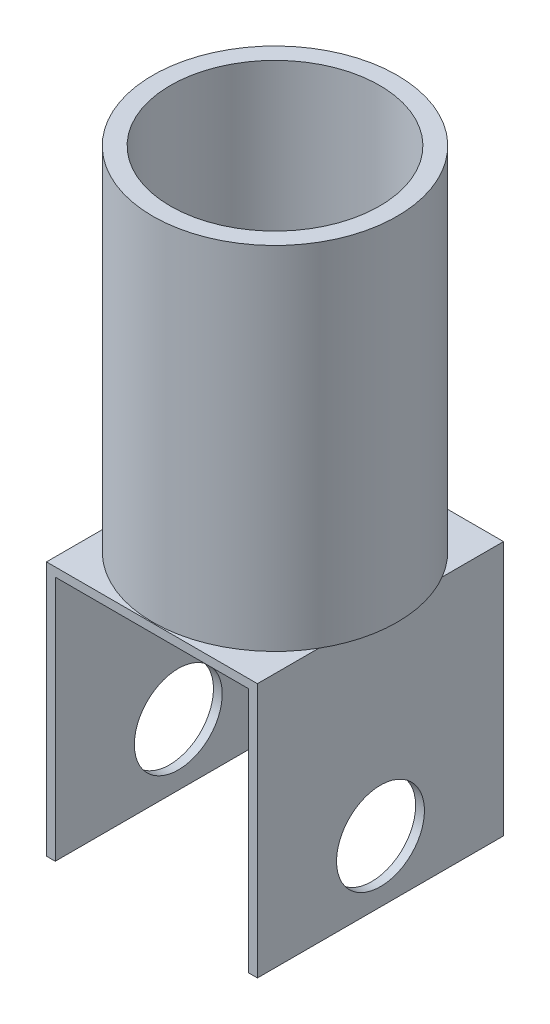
ISO-10303-21;
HEADER;
FILE_DESCRIPTION(('STEP AP214'),'2;1');
FILE_NAME('part.step','',(''),(''),'','','');
FILE_SCHEMA(('AUTOMOTIVE_DESIGN { 1 0 10303 214 1 1 1 1 }'));
ENDSEC;
DATA;
#1=APPLICATION_CONTEXT('core data for automotive mechanical design processes');
#2=APPLICATION_PROTOCOL_DEFINITION('international standard','automotive_design',2000,#1);
#3=PRODUCT_CONTEXT('',#1,'mechanical');
#4=PRODUCT('Part','Part','',(#3));
#5=PRODUCT_RELATED_PRODUCT_CATEGORY('part','',(#4));
#6=PRODUCT_DEFINITION_FORMATION('','',#4);
#7=PRODUCT_DEFINITION_CONTEXT('part definition',#1,'design');
#8=PRODUCT_DEFINITION('design','',#6,#7);
#9=PRODUCT_DEFINITION_SHAPE('','',#8);
#10=(LENGTH_UNIT() NAMED_UNIT(*) SI_UNIT(.MILLI.,.METRE.));
#11=(NAMED_UNIT(*) PLANE_ANGLE_UNIT() SI_UNIT($,.RADIAN.));
#12=(NAMED_UNIT(*) SI_UNIT($,.STERADIAN.) SOLID_ANGLE_UNIT());
#13=UNCERTAINTY_MEASURE_WITH_UNIT(LENGTH_MEASURE(1.E-05),#10,'distance_accuracy_value','');
#14=(GEOMETRIC_REPRESENTATION_CONTEXT(3) GLOBAL_UNCERTAINTY_ASSIGNED_CONTEXT((#13)) GLOBAL_UNIT_ASSIGNED_CONTEXT((#10,
#11,#12)) REPRESENTATION_CONTEXT('',''));
#15=CARTESIAN_POINT('',(0.,0.,0.));
#16=DIRECTION('',(0.,0.,1.));
#17=DIRECTION('',(1.,0.,0.));
#18=AXIS2_PLACEMENT_3D('',#15,#16,#17);
#19=CARTESIAN_POINT('',(0.,-5.,0.));
#20=DIRECTION('',(0.,1.,0.));
#21=DIRECTION('',(0.,0.,1.));
#22=AXIS2_PLACEMENT_3D('',#19,#20,#21);
#23=PLANE('',#22);
#24=DIRECTION('',(0.,0.,-1.));
#25=VECTOR('',#24,1.);
#26=CARTESIAN_POINT('',(55.,-5.,70.));
#27=LINE('',#26,#25);
#28=CARTESIAN_POINT('',(55.,-5.,70.));
#29=VERTEX_POINT('',#28);
#30=CARTESIAN_POINT('',(55.,-5.,-70.));
#31=VERTEX_POINT('',#30);
#32=EDGE_CURVE('E59',#29,#31,#27,.T.);
#33=ORIENTED_EDGE('',*,*,#32,.F.);
#34=DIRECTION('',(-1.,0.,0.));
#35=VECTOR('',#34,1.);
#36=CARTESIAN_POINT('',(-60.,-5.,70.));
#37=LINE('',#36,#35);
#38=CARTESIAN_POINT('',(-55.,-5.,70.));
#39=VERTEX_POINT('',#38);
#40=EDGE_CURVE('E172',#29,#39,#37,.T.);
#41=ORIENTED_EDGE('',*,*,#40,.T.);
#42=DIRECTION('',(0.,0.,1.));
#43=VECTOR('',#42,1.);
#44=CARTESIAN_POINT('',(-55.,-5.,70.));
#45=LINE('',#44,#43);
#46=CARTESIAN_POINT('',(-55.,-5.,-70.));
#47=VERTEX_POINT('',#46);
#48=EDGE_CURVE('E153',#47,#39,#45,.T.);
#49=ORIENTED_EDGE('',*,*,#48,.F.);
#50=DIRECTION('',(1.,0.,0.));
#51=VECTOR('',#50,1.);
#52=CARTESIAN_POINT('',(-60.,-5.,-70.));
#53=LINE('',#52,#51);
#54=EDGE_CURVE('E55',#47,#31,#53,.T.);
#55=ORIENTED_EDGE('',*,*,#54,.T.);
#56=EDGE_LOOP('',(#33,#41,#49,#55));
#57=FACE_BOUND('',#56,.T.);
#58=ADVANCED_FACE('F36',(#57),#23,.F.);
#59=CARTESIAN_POINT('',(0.,0.,0.));
#60=DIRECTION('',(0.,1.,0.));
#61=DIRECTION('',(0.,0.,1.));
#62=AXIS2_PLACEMENT_3D('',#59,#60,#61);
#63=PLANE('',#62);
#64=DIRECTION('',(0.,0.,1.));
#65=VECTOR('',#64,1.);
#66=CARTESIAN_POINT('',(60.,0.,-70.));
#67=LINE('',#66,#65);
#68=CARTESIAN_POINT('',(60.,0.,-35.0749198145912));
#69=VERTEX_POINT('',#68);
#70=CARTESIAN_POINT('',(60.,0.,35.0749198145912));
#71=VERTEX_POINT('',#70);
#72=EDGE_CURVE('E11',#69,#71,#67,.T.);
#73=ORIENTED_EDGE('',*,*,#72,.F.);
#74=CARTESIAN_POINT('',(0.,0.,0.));
#75=DIRECTION('',(0.,1.,0.));
#76=DIRECTION('',(0.,0.,1.));
#77=AXIS2_PLACEMENT_3D('',#74,#75,#76);
#78=CIRCLE('',#77,69.5);
#79=EDGE_CURVE('E198',#71,#69,#78,.T.);
#80=ORIENTED_EDGE('',*,*,#79,.F.);
#81=EDGE_LOOP('',(#73,#80));
#82=FACE_BOUND('',#81,.T.);
#83=ADVANCED_FACE('F246',(#82),#63,.F.);
#84=DIRECTION('',(0.,0.,-1.));
#85=VECTOR('',#84,1.);
#86=CARTESIAN_POINT('',(-60.,0.,-70.));
#87=LINE('',#86,#85);
#88=CARTESIAN_POINT('',(-60.,0.,35.0749198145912));
#89=VERTEX_POINT('',#88);
#90=CARTESIAN_POINT('',(-60.,0.,-35.0749198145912));
#91=VERTEX_POINT('',#90);
#92=EDGE_CURVE('E45',#89,#91,#87,.T.);
#93=ORIENTED_EDGE('',*,*,#92,.F.);
#94=EDGE_CURVE('E204',#91,#89,#78,.T.);
#95=ORIENTED_EDGE('',*,*,#94,.F.);
#96=EDGE_LOOP('',(#93,#95));
#97=FACE_BOUND('',#96,.T.);
#98=ADVANCED_FACE('F250',(#97),#63,.F.);
#99=CARTESIAN_POINT('',(0.,200.,0.));
#100=DIRECTION('',(0.,1.,0.));
#101=DIRECTION('',(0.,0.,1.));
#102=AXIS2_PLACEMENT_3D('',#99,#100,#101);
#103=PLANE('',#102);
#104=CARTESIAN_POINT('',(0.,200.,0.));
#105=DIRECTION('',(0.,1.,0.));
#106=DIRECTION('',(0.,0.,1.));
#107=AXIS2_PLACEMENT_3D('',#104,#105,#106);
#108=CIRCLE('',#107,69.5);
#109=CARTESIAN_POINT('',(0.,200.,69.5));
#110=VERTEX_POINT('',#109);
#111=EDGE_CURVE('E196',#110,#110,#108,.T.);
#112=ORIENTED_EDGE('',*,*,#111,.T.);
#113=EDGE_LOOP('',(#112));
#114=FACE_BOUND('',#113,.T.);
#115=CARTESIAN_POINT('',(0.,200.,0.));
#116=DIRECTION('',(0.,1.,0.));
#117=DIRECTION('',(0.,0.,1.));
#118=AXIS2_PLACEMENT_3D('',#115,#116,#117);
#119=CIRCLE('',#118,59.5);
#120=CARTESIAN_POINT('',(0.,200.,59.5));
#121=VERTEX_POINT('',#120);
#122=EDGE_CURVE('E190',#121,#121,#119,.T.);
#123=ORIENTED_EDGE('',*,*,#122,.F.);
#124=EDGE_LOOP('',(#123));
#125=FACE_BOUND('',#124,.T.);
#126=ADVANCED_FACE('F298',(#114,#125),#103,.T.);
#127=CARTESIAN_POINT('',(0.,200.,0.));
#128=DIRECTION('',(0.,-1.,0.));
#129=DIRECTION('',(0.,0.,-1.));
#130=AXIS2_PLACEMENT_3D('',#127,#128,#129);
#131=CYLINDRICAL_SURFACE('',#130,69.5);
#132=ORIENTED_EDGE('',*,*,#111,.F.);
#133=EDGE_LOOP('',(#132));
#134=FACE_BOUND('',#133,.T.);
#135=ORIENTED_EDGE('',*,*,#79,.T.);
#136=EDGE_CURVE('E200',#69,#91,#78,.T.);
#137=ORIENTED_EDGE('',*,*,#136,.T.);
#138=ORIENTED_EDGE('',*,*,#94,.T.);
#139=EDGE_CURVE('E193',#89,#71,#78,.T.);
#140=ORIENTED_EDGE('',*,*,#139,.T.);
#141=EDGE_LOOP('',(#135,#137,#138,#140));
#142=FACE_BOUND('',#141,.T.);
#143=ADVANCED_FACE('F38',(#134,#142),#131,.T.);
#144=CARTESIAN_POINT('',(0.,200.,0.));
#145=DIRECTION('',(0.,-1.,0.));
#146=DIRECTION('',(0.,0.,-1.));
#147=AXIS2_PLACEMENT_3D('',#144,#145,#146);
#148=CYLINDRICAL_SURFACE('',#147,59.5);
#149=ORIENTED_EDGE('',*,*,#122,.T.);
#150=EDGE_LOOP('',(#149));
#151=FACE_BOUND('',#150,.T.);
#152=CARTESIAN_POINT('',(0.,0.,0.));
#153=DIRECTION('',(0.,1.,0.));
#154=DIRECTION('',(0.,0.,1.));
#155=AXIS2_PLACEMENT_3D('',#152,#153,#154);
#156=CIRCLE('',#155,59.5);
#157=CARTESIAN_POINT('',(0.,0.,59.5));
#158=VERTEX_POINT('',#157);
#159=EDGE_CURVE('E125',#158,#158,#156,.T.);
#160=ORIENTED_EDGE('',*,*,#159,.F.);
#161=EDGE_LOOP('',(#160));
#162=FACE_BOUND('',#161,.T.);
#163=ADVANCED_FACE('F294',(#151,#162),#148,.F.);
#164=CARTESIAN_POINT('',(-60.,-5.,-70.));
#165=DIRECTION('',(0.,0.,1.));
#166=DIRECTION('',(1.,0.,0.));
#167=AXIS2_PLACEMENT_3D('',#164,#165,#166);
#168=PLANE('',#167);
#169=DIRECTION('',(1.,0.,0.));
#170=VECTOR('',#169,1.);
#171=CARTESIAN_POINT('',(-60.,0.,-70.));
#172=LINE('',#171,#170);
#173=CARTESIAN_POINT('',(-60.,0.,-70.));
#174=VERTEX_POINT('',#173);
#175=CARTESIAN_POINT('',(60.,0.,-70.));
#176=VERTEX_POINT('',#175);
#177=EDGE_CURVE('E174',#174,#176,#172,.T.);
#178=ORIENTED_EDGE('',*,*,#177,.T.);
#179=DIRECTION('',(0.,1.,0.));
#180=VECTOR('',#179,1.);
#181=CARTESIAN_POINT('',(60.,-5.,-70.));
#182=LINE('',#181,#180);
#183=CARTESIAN_POINT('',(60.,-145.,-70.));
#184=VERTEX_POINT('',#183);
#185=EDGE_CURVE('E175',#184,#176,#182,.T.);
#186=ORIENTED_EDGE('',*,*,#185,.F.);
#187=DIRECTION('',(1.,0.,0.));
#188=VECTOR('',#187,1.);
#189=CARTESIAN_POINT('',(60.,-145.,-70.));
#190=LINE('',#189,#188);
#191=CARTESIAN_POINT('',(55.,-145.,-70.));
#192=VERTEX_POINT('',#191);
#193=EDGE_CURVE('E140',#192,#184,#190,.T.);
#194=ORIENTED_EDGE('',*,*,#193,.F.);
#195=DIRECTION('',(0.,1.,0.));
#196=VECTOR('',#195,1.);
#197=CARTESIAN_POINT('',(55.,-145.,-70.));
#198=LINE('',#197,#196);
#199=EDGE_CURVE('E148',#192,#31,#198,.T.);
#200=ORIENTED_EDGE('',*,*,#199,.T.);
#201=ORIENTED_EDGE('',*,*,#54,.F.);
#202=DIRECTION('',(0.,1.,0.));
#203=VECTOR('',#202,1.);
#204=CARTESIAN_POINT('',(-55.,-145.,-70.));
#205=LINE('',#204,#203);
#206=CARTESIAN_POINT('',(-55.,-145.,-70.));
#207=VERTEX_POINT('',#206);
#208=EDGE_CURVE('E169',#207,#47,#205,.T.);
#209=ORIENTED_EDGE('',*,*,#208,.F.);
#210=DIRECTION('',(1.,0.,0.));
#211=VECTOR('',#210,1.);
#212=CARTESIAN_POINT('',(-60.,-145.,-70.));
#213=LINE('',#212,#211);
#214=CARTESIAN_POINT('',(-60.,-145.,-70.));
#215=VERTEX_POINT('',#214);
#216=EDGE_CURVE('E157',#215,#207,#213,.T.);
#217=ORIENTED_EDGE('',*,*,#216,.F.);
#218=DIRECTION('',(0.,1.,0.));
#219=VECTOR('',#218,1.);
#220=CARTESIAN_POINT('',(-60.,-5.,-70.));
#221=LINE('',#220,#219);
#222=EDGE_CURVE('E185',#215,#174,#221,.T.);
#223=ORIENTED_EDGE('',*,*,#222,.T.);
#224=EDGE_LOOP('',(#178,#186,#194,#200,#201,#209,#217,#223));
#225=FACE_BOUND('',#224,.T.);
#226=ADVANCED_FACE('F230',(#225),#168,.F.);
#227=CARTESIAN_POINT('',(-60.,-5.,-70.));
#228=DIRECTION('',(1.,0.,0.));
#229=DIRECTION('',(0.,0.,-1.));
#230=AXIS2_PLACEMENT_3D('',#227,#228,#229);
#231=PLANE('',#230);
#232=CARTESIAN_POINT('',(-60.,-110.,0.));
#233=DIRECTION('',(1.,0.,0.));
#234=DIRECTION('',(0.,0.,-1.));
#235=AXIS2_PLACEMENT_3D('',#232,#233,#234);
#236=CIRCLE('',#235,25.);
#237=CARTESIAN_POINT('',(-60.,-110.,-25.));
#238=VERTEX_POINT('',#237);
#239=EDGE_CURVE('E142',#238,#238,#236,.T.);
#240=ORIENTED_EDGE('',*,*,#239,.T.);
#241=EDGE_LOOP('',(#240));
#242=FACE_BOUND('',#241,.T.);
#243=CARTESIAN_POINT('',(-60.,0.,70.));
#244=VERTEX_POINT('',#243);
#245=EDGE_CURVE('E180',#244,#89,#87,.T.);
#246=ORIENTED_EDGE('',*,*,#245,.T.);
#247=ORIENTED_EDGE('',*,*,#92,.T.);
#248=EDGE_CURVE('E179',#91,#174,#87,.T.);
#249=ORIENTED_EDGE('',*,*,#248,.T.);
#250=ORIENTED_EDGE('',*,*,#222,.F.);
#251=DIRECTION('',(0.,0.,-1.));
#252=VECTOR('',#251,1.);
#253=CARTESIAN_POINT('',(-60.,-145.,70.));
#254=LINE('',#253,#252);
#255=CARTESIAN_POINT('',(-60.,-145.,70.));
#256=VERTEX_POINT('',#255);
#257=EDGE_CURVE('E154',#256,#215,#254,.T.);
#258=ORIENTED_EDGE('',*,*,#257,.F.);
#259=DIRECTION('',(0.,1.,0.));
#260=VECTOR('',#259,1.);
#261=CARTESIAN_POINT('',(-60.,-5.,70.));
#262=LINE('',#261,#260);
#263=EDGE_CURVE('E126',#256,#244,#262,.T.);
#264=ORIENTED_EDGE('',*,*,#263,.T.);
#265=EDGE_LOOP('',(#246,#247,#249,#250,#258,#264));
#266=FACE_BOUND('',#265,.T.);
#267=ADVANCED_FACE('F215',(#242,#266),#231,.F.);
#268=CARTESIAN_POINT('',(-60.,-5.,70.));
#269=DIRECTION('',(0.,0.,-1.));
#270=DIRECTION('',(-1.,0.,0.));
#271=AXIS2_PLACEMENT_3D('',#268,#269,#270);
#272=PLANE('',#271);
#273=DIRECTION('',(-1.,0.,0.));
#274=VECTOR('',#273,1.);
#275=CARTESIAN_POINT('',(-60.,0.,70.));
#276=LINE('',#275,#274);
#277=CARTESIAN_POINT('',(60.,0.,70.));
#278=VERTEX_POINT('',#277);
#279=EDGE_CURVE('E177',#278,#244,#276,.T.);
#280=ORIENTED_EDGE('',*,*,#279,.T.);
#281=ORIENTED_EDGE('',*,*,#263,.F.);
#282=DIRECTION('',(-1.,0.,0.));
#283=VECTOR('',#282,1.);
#284=CARTESIAN_POINT('',(-60.,-145.,70.));
#285=LINE('',#284,#283);
#286=CARTESIAN_POINT('',(-55.,-145.,70.));
#287=VERTEX_POINT('',#286);
#288=EDGE_CURVE('E161',#287,#256,#285,.T.);
#289=ORIENTED_EDGE('',*,*,#288,.F.);
#290=DIRECTION('',(0.,1.,0.));
#291=VECTOR('',#290,1.);
#292=CARTESIAN_POINT('',(-55.,-145.,70.));
#293=LINE('',#292,#291);
#294=EDGE_CURVE('E164',#287,#39,#293,.T.);
#295=ORIENTED_EDGE('',*,*,#294,.T.);
#296=ORIENTED_EDGE('',*,*,#40,.F.);
#297=DIRECTION('',(0.,1.,0.));
#298=VECTOR('',#297,1.);
#299=CARTESIAN_POINT('',(55.,-145.,70.));
#300=LINE('',#299,#298);
#301=CARTESIAN_POINT('',(55.,-145.,70.));
#302=VERTEX_POINT('',#301);
#303=EDGE_CURVE('E132',#302,#29,#300,.T.);
#304=ORIENTED_EDGE('',*,*,#303,.F.);
#305=DIRECTION('',(-1.,0.,0.));
#306=VECTOR('',#305,1.);
#307=CARTESIAN_POINT('',(60.,-145.,70.));
#308=LINE('',#307,#306);
#309=CARTESIAN_POINT('',(60.,-145.,70.));
#310=VERTEX_POINT('',#309);
#311=EDGE_CURVE('E129',#310,#302,#308,.T.);
#312=ORIENTED_EDGE('',*,*,#311,.F.);
#313=DIRECTION('',(0.,1.,0.));
#314=VECTOR('',#313,1.);
#315=CARTESIAN_POINT('',(60.,-5.,70.));
#316=LINE('',#315,#314);
#317=EDGE_CURVE('E115',#310,#278,#316,.T.);
#318=ORIENTED_EDGE('',*,*,#317,.T.);
#319=EDGE_LOOP('',(#280,#281,#289,#295,#296,#304,#312,#318));
#320=FACE_BOUND('',#319,.T.);
#321=ADVANCED_FACE('F130',(#320),#272,.F.);
#322=CARTESIAN_POINT('',(60.,-5.,-70.));
#323=DIRECTION('',(-1.,0.,0.));
#324=DIRECTION('',(0.,0.,1.));
#325=AXIS2_PLACEMENT_3D('',#322,#323,#324);
#326=PLANE('',#325);
#327=CARTESIAN_POINT('',(60.,-110.,0.));
#328=DIRECTION('',(-1.,0.,0.));
#329=DIRECTION('',(0.,0.,1.));
#330=AXIS2_PLACEMENT_3D('',#327,#328,#329);
#331=CIRCLE('',#330,25.);
#332=CARTESIAN_POINT('',(60.,-110.,25.));
#333=VERTEX_POINT('',#332);
#334=EDGE_CURVE('E278',#333,#333,#331,.T.);
#335=ORIENTED_EDGE('',*,*,#334,.T.);
#336=EDGE_LOOP('',(#335));
#337=FACE_BOUND('',#336,.T.);
#338=EDGE_CURVE('E47',#176,#69,#67,.T.);
#339=ORIENTED_EDGE('',*,*,#338,.T.);
#340=ORIENTED_EDGE('',*,*,#72,.T.);
#341=EDGE_CURVE('E48',#71,#278,#67,.T.);
#342=ORIENTED_EDGE('',*,*,#341,.T.);
#343=ORIENTED_EDGE('',*,*,#317,.F.);
#344=DIRECTION('',(0.,0.,1.));
#345=VECTOR('',#344,1.);
#346=CARTESIAN_POINT('',(60.,-145.,70.));
#347=LINE('',#346,#345);
#348=EDGE_CURVE('E121',#184,#310,#347,.T.);
#349=ORIENTED_EDGE('',*,*,#348,.F.);
#350=ORIENTED_EDGE('',*,*,#185,.T.);
#351=EDGE_LOOP('',(#339,#340,#342,#343,#349,#350));
#352=FACE_BOUND('',#351,.T.);
#353=ADVANCED_FACE('F118',(#337,#352),#326,.F.);
#354=CARTESIAN_POINT('',(0.,0.,0.));
#355=DIRECTION('',(0.,1.,0.));
#356=DIRECTION('',(0.,0.,1.));
#357=AXIS2_PLACEMENT_3D('',#354,#355,#356);
#358=PLANE('',#357);
#359=ORIENTED_EDGE('',*,*,#139,.F.);
#360=ORIENTED_EDGE('',*,*,#245,.F.);
#361=ORIENTED_EDGE('',*,*,#279,.F.);
#362=ORIENTED_EDGE('',*,*,#341,.F.);
#363=EDGE_LOOP('',(#359,#360,#361,#362));
#364=FACE_BOUND('',#363,.T.);
#365=ADVANCED_FACE('F212',(#364),#358,.T.);
#366=ORIENTED_EDGE('',*,*,#136,.F.);
#367=ORIENTED_EDGE('',*,*,#338,.F.);
#368=ORIENTED_EDGE('',*,*,#177,.F.);
#369=ORIENTED_EDGE('',*,*,#248,.F.);
#370=EDGE_LOOP('',(#366,#367,#368,#369));
#371=FACE_BOUND('',#370,.T.);
#372=ADVANCED_FACE('F234',(#371),#358,.T.);
#373=ORIENTED_EDGE('',*,*,#159,.T.);
#374=EDGE_LOOP('',(#373));
#375=FACE_BOUND('',#374,.T.);
#376=ADVANCED_FACE('F236',(#375),#358,.T.);
#377=CARTESIAN_POINT('',(-55.,-145.,70.));
#378=DIRECTION('',(-1.,0.,0.));
#379=DIRECTION('',(0.,0.,1.));
#380=AXIS2_PLACEMENT_3D('',#377,#378,#379);
#381=PLANE('',#380);
#382=CARTESIAN_POINT('',(-55.,-110.,0.));
#383=DIRECTION('',(-1.,0.,0.));
#384=DIRECTION('',(0.,0.,1.));
#385=AXIS2_PLACEMENT_3D('',#382,#383,#384);
#386=CIRCLE('',#385,25.);
#387=CARTESIAN_POINT('',(-55.,-110.,25.));
#388=VERTEX_POINT('',#387);
#389=EDGE_CURVE('E274',#388,#388,#386,.T.);
#390=ORIENTED_EDGE('',*,*,#389,.T.);
#391=EDGE_LOOP('',(#390));
#392=FACE_BOUND('',#391,.T.);
#393=ORIENTED_EDGE('',*,*,#48,.T.);
#394=ORIENTED_EDGE('',*,*,#294,.F.);
#395=DIRECTION('',(0.,0.,1.));
#396=VECTOR('',#395,1.);
#397=CARTESIAN_POINT('',(-55.,-145.,70.));
#398=LINE('',#397,#396);
#399=EDGE_CURVE('E159',#207,#287,#398,.T.);
#400=ORIENTED_EDGE('',*,*,#399,.F.);
#401=ORIENTED_EDGE('',*,*,#208,.T.);
#402=EDGE_LOOP('',(#393,#394,#400,#401));
#403=FACE_BOUND('',#402,.T.);
#404=ADVANCED_FACE('F225',(#392,#403),#381,.F.);
#405=CARTESIAN_POINT('',(0.,-145.,0.));
#406=DIRECTION('',(0.,-1.,0.));
#407=DIRECTION('',(0.,0.,-1.));
#408=AXIS2_PLACEMENT_3D('',#405,#406,#407);
#409=PLANE('',#408);
#410=ORIENTED_EDGE('',*,*,#257,.T.);
#411=ORIENTED_EDGE('',*,*,#216,.T.);
#412=ORIENTED_EDGE('',*,*,#399,.T.);
#413=ORIENTED_EDGE('',*,*,#288,.T.);
#414=EDGE_LOOP('',(#410,#411,#412,#413));
#415=FACE_BOUND('',#414,.T.);
#416=ADVANCED_FACE('F219',(#415),#409,.T.);
#417=CARTESIAN_POINT('',(55.,-145.,70.));
#418=DIRECTION('',(1.,0.,0.));
#419=DIRECTION('',(0.,0.,-1.));
#420=AXIS2_PLACEMENT_3D('',#417,#418,#419);
#421=PLANE('',#420);
#422=CARTESIAN_POINT('',(55.,-110.,0.));
#423=DIRECTION('',(1.,0.,0.));
#424=DIRECTION('',(0.,0.,-1.));
#425=AXIS2_PLACEMENT_3D('',#422,#423,#424);
#426=CIRCLE('',#425,25.);
#427=CARTESIAN_POINT('',(55.,-110.,-25.));
#428=VERTEX_POINT('',#427);
#429=EDGE_CURVE('E40',#428,#428,#426,.T.);
#430=ORIENTED_EDGE('',*,*,#429,.T.);
#431=EDGE_LOOP('',(#430));
#432=FACE_BOUND('',#431,.T.);
#433=ORIENTED_EDGE('',*,*,#32,.T.);
#434=ORIENTED_EDGE('',*,*,#199,.F.);
#435=DIRECTION('',(0.,0.,-1.));
#436=VECTOR('',#435,1.);
#437=CARTESIAN_POINT('',(55.,-145.,70.));
#438=LINE('',#437,#436);
#439=EDGE_CURVE('E135',#302,#192,#438,.T.);
#440=ORIENTED_EDGE('',*,*,#439,.F.);
#441=ORIENTED_EDGE('',*,*,#303,.T.);
#442=EDGE_LOOP('',(#433,#434,#440,#441));
#443=FACE_BOUND('',#442,.T.);
#444=ADVANCED_FACE('F227',(#432,#443),#421,.F.);
#445=CARTESIAN_POINT('',(0.,-145.,0.));
#446=DIRECTION('',(0.,1.,0.));
#447=DIRECTION('',(0.,0.,1.));
#448=AXIS2_PLACEMENT_3D('',#445,#446,#447);
#449=PLANE('',#448);
#450=ORIENTED_EDGE('',*,*,#348,.T.);
#451=ORIENTED_EDGE('',*,*,#311,.T.);
#452=ORIENTED_EDGE('',*,*,#439,.T.);
#453=ORIENTED_EDGE('',*,*,#193,.T.);
#454=EDGE_LOOP('',(#450,#451,#452,#453));
#455=FACE_BOUND('',#454,.T.);
#456=ADVANCED_FACE('F138',(#455),#449,.F.);
#457=CARTESIAN_POINT('',(69.5,-110.,0.));
#458=DIRECTION('',(-1.,0.,0.));
#459=DIRECTION('',(0.,0.,1.));
#460=AXIS2_PLACEMENT_3D('',#457,#458,#459);
#461=CYLINDRICAL_SURFACE('',#460,25.);
#462=ORIENTED_EDGE('',*,*,#429,.F.);
#463=EDGE_LOOP('',(#462));
#464=FACE_BOUND('',#463,.T.);
#465=ORIENTED_EDGE('',*,*,#334,.F.);
#466=EDGE_LOOP('',(#465));
#467=FACE_BOUND('',#466,.T.);
#468=ADVANCED_FACE('F263',(#464,#467),#461,.F.);
#469=ORIENTED_EDGE('',*,*,#389,.F.);
#470=EDGE_LOOP('',(#469));
#471=FACE_BOUND('',#470,.T.);
#472=ORIENTED_EDGE('',*,*,#239,.F.);
#473=EDGE_LOOP('',(#472));
#474=FACE_BOUND('',#473,.T.);
#475=ADVANCED_FACE('F264',(#471,#474),#461,.F.);
#476=CLOSED_SHELL('',(#58,#83,#98,#126,#143,#163,#226,#267,#321,#353,#365,#372,#376,#404,#416,
#444,#456,#468,#475));
#477=MANIFOLD_SOLID_BREP('B2',#476);
#478=ADVANCED_BREP_SHAPE_REPRESENTATION('',(#18,#477),#14);
#479=SHAPE_DEFINITION_REPRESENTATION(#9,#478);
ENDSEC;
END-ISO-10303-21;
